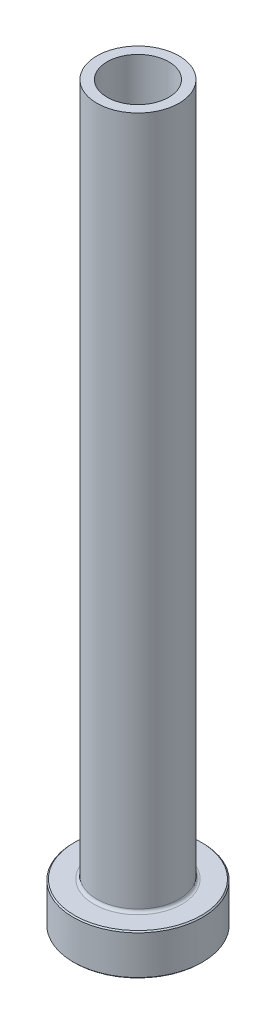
ISO-10303-21;
HEADER;
FILE_DESCRIPTION(('STEP AP214'),'2;1');
FILE_NAME('part.step','',(''),(''),'','','');
FILE_SCHEMA(('AUTOMOTIVE_DESIGN { 1 0 10303 214 1 1 1 1 }'));
ENDSEC;
DATA;
#1=APPLICATION_CONTEXT('core data for automotive mechanical design processes');
#2=APPLICATION_PROTOCOL_DEFINITION('international standard','automotive_design',2000,#1);
#3=PRODUCT_CONTEXT('',#1,'mechanical');
#4=PRODUCT('Part','Part','',(#3));
#5=PRODUCT_RELATED_PRODUCT_CATEGORY('part','',(#4));
#6=PRODUCT_DEFINITION_FORMATION('','',#4);
#7=PRODUCT_DEFINITION_CONTEXT('part definition',#1,'design');
#8=PRODUCT_DEFINITION('design','',#6,#7);
#9=PRODUCT_DEFINITION_SHAPE('','',#8);
#10=(LENGTH_UNIT() NAMED_UNIT(*) SI_UNIT(.MILLI.,.METRE.));
#11=(NAMED_UNIT(*) PLANE_ANGLE_UNIT() SI_UNIT($,.RADIAN.));
#12=(NAMED_UNIT(*) SI_UNIT($,.STERADIAN.) SOLID_ANGLE_UNIT());
#13=UNCERTAINTY_MEASURE_WITH_UNIT(LENGTH_MEASURE(1.E-05),#10,'distance_accuracy_value','');
#14=(GEOMETRIC_REPRESENTATION_CONTEXT(3) GLOBAL_UNCERTAINTY_ASSIGNED_CONTEXT((#13)) GLOBAL_UNIT_ASSIGNED_CONTEXT((#10,
#11,#12)) REPRESENTATION_CONTEXT('',''));
#15=CARTESIAN_POINT('',(0.,0.,0.));
#16=DIRECTION('',(0.,0.,1.));
#17=DIRECTION('',(1.,0.,0.));
#18=AXIS2_PLACEMENT_3D('',#15,#16,#17);
#19=CARTESIAN_POINT('',(0.,92.1876809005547,0.));
#20=DIRECTION('',(0.,1.,0.));
#21=DIRECTION('',(0.,0.,1.));
#22=AXIS2_PLACEMENT_3D('',#19,#20,#21);
#23=CYLINDRICAL_SURFACE('',#22,5.24999999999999);
#24=CARTESIAN_POINT('',(0.,125.,0.));
#25=DIRECTION('',(0.,1.,0.));
#26=DIRECTION('',(0.,0.,1.));
#27=AXIS2_PLACEMENT_3D('',#24,#25,#26);
#28=CIRCLE('',#27,5.24999999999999);
#29=CARTESIAN_POINT('',(0.,125.,5.24999999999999));
#30=VERTEX_POINT('',#29);
#31=EDGE_CURVE('E62',#30,#30,#28,.T.);
#32=ORIENTED_EDGE('',*,*,#31,.T.);
#33=EDGE_LOOP('',(#32));
#34=FACE_BOUND('',#33,.T.);
#35=CARTESIAN_POINT('',(0.,70.,0.));
#36=DIRECTION('',(0.,1.,0.));
#37=DIRECTION('',(0.,0.,1.));
#38=AXIS2_PLACEMENT_3D('',#35,#36,#37);
#39=CIRCLE('',#38,5.24999999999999);
#40=CARTESIAN_POINT('',(0.,70.,5.24999999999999));
#41=VERTEX_POINT('',#40);
#42=EDGE_CURVE('E71',#41,#41,#39,.T.);
#43=ORIENTED_EDGE('',*,*,#42,.F.);
#44=EDGE_LOOP('',(#43));
#45=FACE_BOUND('',#44,.T.);
#46=ADVANCED_FACE('F30',(#34,#45),#23,.F.);
#47=CARTESIAN_POINT('',(-5.24999999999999,125.,0.));
#48=DIRECTION('',(0.,1.,0.));
#49=DIRECTION('',(0.,0.,1.));
#50=AXIS2_PLACEMENT_3D('',#47,#48,#49);
#51=PLANE('',#50);
#52=CARTESIAN_POINT('',(0.,125.,0.));
#53=DIRECTION('',(0.,1.,0.));
#54=DIRECTION('',(0.,0.,1.));
#55=AXIS2_PLACEMENT_3D('',#52,#53,#54);
#56=CIRCLE('',#55,7.);
#57=CARTESIAN_POINT('',(0.,125.,7.));
#58=VERTEX_POINT('',#57);
#59=EDGE_CURVE('E65',#58,#58,#56,.T.);
#60=ORIENTED_EDGE('',*,*,#59,.T.);
#61=EDGE_LOOP('',(#60));
#62=FACE_BOUND('',#61,.T.);
#63=ORIENTED_EDGE('',*,*,#31,.F.);
#64=EDGE_LOOP('',(#63));
#65=FACE_BOUND('',#64,.T.);
#66=ADVANCED_FACE('F79',(#62,#65),#51,.T.);
#67=CARTESIAN_POINT('',(0.,92.1876809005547,0.));
#68=DIRECTION('',(0.,1.,0.));
#69=DIRECTION('',(0.,0.,1.));
#70=AXIS2_PLACEMENT_3D('',#67,#68,#69);
#71=CYLINDRICAL_SURFACE('',#70,7.);
#72=CARTESIAN_POINT('',(0.,7.50000000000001,0.));
#73=DIRECTION('',(0.,1.,0.));
#74=DIRECTION('',(0.,0.,1.));
#75=AXIS2_PLACEMENT_3D('',#72,#73,#74);
#76=CIRCLE('',#75,7.);
#77=CARTESIAN_POINT('',(0.,7.50000000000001,7.));
#78=VERTEX_POINT('',#77);
#79=EDGE_CURVE('E59',#78,#78,#76,.T.);
#80=ORIENTED_EDGE('',*,*,#79,.T.);
#81=EDGE_LOOP('',(#80));
#82=FACE_BOUND('',#81,.T.);
#83=ORIENTED_EDGE('',*,*,#59,.F.);
#84=EDGE_LOOP('',(#83));
#85=FACE_BOUND('',#84,.T.);
#86=ADVANCED_FACE('F85',(#82,#85),#71,.T.);
#87=CARTESIAN_POINT('',(-6.99999999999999,7.,0.));
#88=DIRECTION('',(0.,1.,0.));
#89=DIRECTION('',(0.,0.,1.));
#90=AXIS2_PLACEMENT_3D('',#87,#88,#89);
#91=PLANE('',#90);
#92=CARTESIAN_POINT('',(0.,7.,0.));
#93=DIRECTION('',(0.,1.,0.));
#94=DIRECTION('',(0.,0.,1.));
#95=AXIS2_PLACEMENT_3D('',#92,#93,#94);
#96=CIRCLE('',#95,10.8);
#97=CARTESIAN_POINT('',(0.,7.,10.8));
#98=VERTEX_POINT('',#97);
#99=EDGE_CURVE('E53',#98,#98,#96,.T.);
#100=ORIENTED_EDGE('',*,*,#99,.T.);
#101=EDGE_LOOP('',(#100));
#102=FACE_BOUND('',#101,.T.);
#103=CARTESIAN_POINT('',(0.,7.,0.));
#104=DIRECTION('',(0.,1.,0.));
#105=DIRECTION('',(0.,0.,1.));
#106=AXIS2_PLACEMENT_3D('',#103,#104,#105);
#107=CIRCLE('',#106,7.5);
#108=CARTESIAN_POINT('',(0.,7.,7.5));
#109=VERTEX_POINT('',#108);
#110=EDGE_CURVE('E56',#109,#109,#107,.F.);
#111=ORIENTED_EDGE('',*,*,#110,.T.);
#112=EDGE_LOOP('',(#111));
#113=FACE_BOUND('',#112,.T.);
#114=ADVANCED_FACE('F111',(#102,#113),#91,.T.);
#115=CARTESIAN_POINT('',(0.,92.1876809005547,0.));
#116=DIRECTION('',(0.,1.,0.));
#117=DIRECTION('',(0.,0.,1.));
#118=AXIS2_PLACEMENT_3D('',#115,#116,#117);
#119=CYLINDRICAL_SURFACE('',#118,11.);
#120=CARTESIAN_POINT('',(0.,6.80000000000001,0.));
#121=DIRECTION('',(0.,1.,0.));
#122=DIRECTION('',(0.,0.,1.));
#123=AXIS2_PLACEMENT_3D('',#120,#121,#122);
#124=CIRCLE('',#123,11.);
#125=CARTESIAN_POINT('',(0.,6.80000000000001,11.));
#126=VERTEX_POINT('',#125);
#127=EDGE_CURVE('E45',#126,#126,#124,.F.);
#128=ORIENTED_EDGE('',*,*,#127,.T.);
#129=EDGE_LOOP('',(#128));
#130=FACE_BOUND('',#129,.T.);
#131=CARTESIAN_POINT('',(0.,0.20000000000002,0.));
#132=DIRECTION('',(0.,-1.,0.));
#133=DIRECTION('',(0.,0.,-1.));
#134=AXIS2_PLACEMENT_3D('',#131,#132,#133);
#135=CIRCLE('',#134,11.);
#136=CARTESIAN_POINT('',(0.,0.20000000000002,-11.));
#137=VERTEX_POINT('',#136);
#138=EDGE_CURVE('E50',#137,#137,#135,.F.);
#139=ORIENTED_EDGE('',*,*,#138,.T.);
#140=EDGE_LOOP('',(#139));
#141=FACE_BOUND('',#140,.T.);
#142=ADVANCED_FACE('F108',(#130,#141),#119,.T.);
#143=CARTESIAN_POINT('',(-11.,0.,0.));
#144=DIRECTION('',(0.,-1.,0.));
#145=DIRECTION('',(0.,0.,-1.));
#146=AXIS2_PLACEMENT_3D('',#143,#144,#145);
#147=PLANE('',#146);
#148=CARTESIAN_POINT('',(0.,0.,0.));
#149=DIRECTION('',(0.,-1.,0.));
#150=DIRECTION('',(0.,0.,-1.));
#151=AXIS2_PLACEMENT_3D('',#148,#149,#150);
#152=CIRCLE('',#151,5.99999999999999);
#153=CARTESIAN_POINT('',(0.,0.,-5.99999999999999));
#154=VERTEX_POINT('',#153);
#155=EDGE_CURVE('E37',#154,#154,#152,.F.);
#156=ORIENTED_EDGE('',*,*,#155,.T.);
#157=EDGE_LOOP('',(#156));
#158=FACE_BOUND('',#157,.T.);
#159=CARTESIAN_POINT('',(0.,0.,0.));
#160=DIRECTION('',(0.,-1.,0.));
#161=DIRECTION('',(0.,0.,-1.));
#162=AXIS2_PLACEMENT_3D('',#159,#160,#161);
#163=CIRCLE('',#162,10.8);
#164=CARTESIAN_POINT('',(0.,0.,-10.8));
#165=VERTEX_POINT('',#164);
#166=EDGE_CURVE('E41',#165,#165,#163,.T.);
#167=ORIENTED_EDGE('',*,*,#166,.T.);
#168=EDGE_LOOP('',(#167));
#169=FACE_BOUND('',#168,.T.);
#170=ADVANCED_FACE('F110',(#158,#169),#147,.T.);
#171=CARTESIAN_POINT('',(0.,92.1876809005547,0.));
#172=DIRECTION('',(0.,1.,0.));
#173=DIRECTION('',(0.,0.,1.));
#174=AXIS2_PLACEMENT_3D('',#171,#172,#173);
#175=CYLINDRICAL_SURFACE('',#174,5.49999999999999);
#176=CARTESIAN_POINT('',(0.,0.5,0.));
#177=DIRECTION('',(0.,-1.,0.));
#178=DIRECTION('',(0.,0.,-1.));
#179=AXIS2_PLACEMENT_3D('',#176,#177,#178);
#180=CIRCLE('',#179,5.49999999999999);
#181=CARTESIAN_POINT('',(0.,0.5,-5.49999999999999));
#182=VERTEX_POINT('',#181);
#183=EDGE_CURVE('E10',#182,#182,#180,.T.);
#184=ORIENTED_EDGE('',*,*,#183,.T.);
#185=EDGE_LOOP('',(#184));
#186=FACE_BOUND('',#185,.T.);
#187=CARTESIAN_POINT('',(0.,58.,0.));
#188=DIRECTION('',(0.,1.,0.));
#189=DIRECTION('',(0.,0.,1.));
#190=AXIS2_PLACEMENT_3D('',#187,#188,#189);
#191=CIRCLE('',#190,5.5);
#192=CARTESIAN_POINT('',(0.,58.,5.5));
#193=VERTEX_POINT('',#192);
#194=EDGE_CURVE('E68',#193,#193,#191,.T.);
#195=ORIENTED_EDGE('',*,*,#194,.T.);
#196=EDGE_LOOP('',(#195));
#197=FACE_BOUND('',#196,.T.);
#198=ADVANCED_FACE('F118',(#186,#197),#175,.F.);
#199=CARTESIAN_POINT('',(0.,58.,0.));
#200=DIRECTION('',(0.,-1.,0.));
#201=DIRECTION('',(0.,0.,-1.));
#202=AXIS2_PLACEMENT_3D('',#199,#200,#201);
#203=CONICAL_SURFACE('',#202,5.5,0.0208303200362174);
#204=ORIENTED_EDGE('',*,*,#42,.T.);
#205=EDGE_LOOP('',(#204));
#206=FACE_BOUND('',#205,.T.);
#207=ORIENTED_EDGE('',*,*,#194,.F.);
#208=EDGE_LOOP('',(#207));
#209=FACE_BOUND('',#208,.T.);
#210=ADVANCED_FACE('F75',(#206,#209),#203,.F.);
#211=CARTESIAN_POINT('',(0.,7.50000000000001,0.));
#212=DIRECTION('',(0.,1.,0.));
#213=DIRECTION('',(0.,0.,1.));
#214=AXIS2_PLACEMENT_3D('',#211,#212,#213);
#215=TOROIDAL_SURFACE('',#214,7.5,0.5);
#216=ORIENTED_EDGE('',*,*,#110,.F.);
#217=EDGE_LOOP('',(#216));
#218=FACE_BOUND('',#217,.T.);
#219=ORIENTED_EDGE('',*,*,#79,.F.);
#220=EDGE_LOOP('',(#219));
#221=FACE_BOUND('',#220,.T.);
#222=ADVANCED_FACE('F90',(#218,#221),#215,.F.);
#223=CARTESIAN_POINT('',(0.,7.00000000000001,0.));
#224=DIRECTION('',(0.,-1.,0.));
#225=DIRECTION('',(0.,0.,-1.));
#226=AXIS2_PLACEMENT_3D('',#223,#224,#225);
#227=CONICAL_SURFACE('',#226,10.8,0.785398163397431);
#228=ORIENTED_EDGE('',*,*,#127,.F.);
#229=EDGE_LOOP('',(#228));
#230=FACE_BOUND('',#229,.T.);
#231=ORIENTED_EDGE('',*,*,#99,.F.);
#232=EDGE_LOOP('',(#231));
#233=FACE_BOUND('',#232,.T.);
#234=ADVANCED_FACE('F93',(#230,#233),#227,.T.);
#235=CARTESIAN_POINT('',(0.,0.20000000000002,0.));
#236=DIRECTION('',(0.,1.,0.));
#237=DIRECTION('',(0.,0.,1.));
#238=AXIS2_PLACEMENT_3D('',#235,#236,#237);
#239=CONICAL_SURFACE('',#238,11.,0.785398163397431);
#240=ORIENTED_EDGE('',*,*,#166,.F.);
#241=EDGE_LOOP('',(#240));
#242=FACE_BOUND('',#241,.T.);
#243=ORIENTED_EDGE('',*,*,#138,.F.);
#244=EDGE_LOOP('',(#243));
#245=FACE_BOUND('',#244,.T.);
#246=ADVANCED_FACE('F96',(#242,#245),#239,.T.);
#247=CARTESIAN_POINT('',(0.,0.,0.));
#248=DIRECTION('',(0.,-1.,0.));
#249=DIRECTION('',(0.,0.,-1.));
#250=AXIS2_PLACEMENT_3D('',#247,#248,#249);
#251=CONICAL_SURFACE('',#250,5.99999999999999,0.785398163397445);
#252=ORIENTED_EDGE('',*,*,#183,.F.);
#253=EDGE_LOOP('',(#252));
#254=FACE_BOUND('',#253,.T.);
#255=ORIENTED_EDGE('',*,*,#155,.F.);
#256=EDGE_LOOP('',(#255));
#257=FACE_BOUND('',#256,.T.);
#258=ADVANCED_FACE('F32',(#254,#257),#251,.F.);
#259=CLOSED_SHELL('',(#46,#66,#86,#114,#142,#170,#198,#210,#222,#234,#246,#258));
#260=MANIFOLD_SOLID_BREP('B2',#259);
#261=ADVANCED_BREP_SHAPE_REPRESENTATION('',(#18,#260),#14);
#262=SHAPE_DEFINITION_REPRESENTATION(#9,#261);
ENDSEC;
END-ISO-10303-21;
